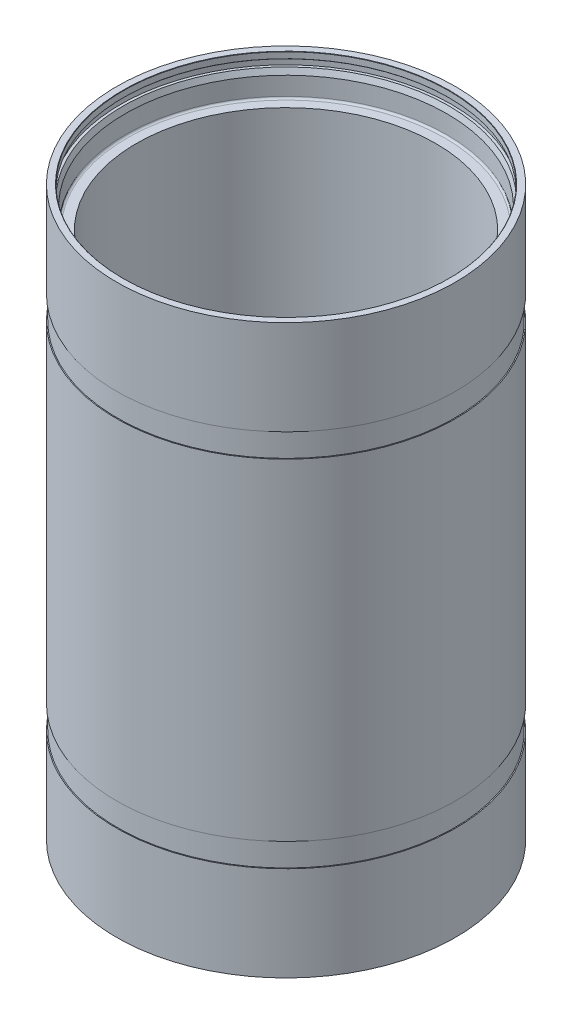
ISO-10303-21;
HEADER;
FILE_DESCRIPTION(('STEP AP214'),'2;1');
FILE_NAME('part.step','',(''),(''),'','','');
FILE_SCHEMA(('AUTOMOTIVE_DESIGN { 1 0 10303 214 1 1 1 1 }'));
ENDSEC;
DATA;
#1=APPLICATION_CONTEXT('core data for automotive mechanical design processes');
#2=APPLICATION_PROTOCOL_DEFINITION('international standard','automotive_design',2000,#1);
#3=PRODUCT_CONTEXT('',#1,'mechanical');
#4=PRODUCT('Part','Part','',(#3));
#5=PRODUCT_RELATED_PRODUCT_CATEGORY('part','',(#4));
#6=PRODUCT_DEFINITION_FORMATION('','',#4);
#7=PRODUCT_DEFINITION_CONTEXT('part definition',#1,'design');
#8=PRODUCT_DEFINITION('design','',#6,#7);
#9=PRODUCT_DEFINITION_SHAPE('','',#8);
#10=(LENGTH_UNIT() NAMED_UNIT(*) SI_UNIT(.MILLI.,.METRE.));
#11=(NAMED_UNIT(*) PLANE_ANGLE_UNIT() SI_UNIT($,.RADIAN.));
#12=(NAMED_UNIT(*) SI_UNIT($,.STERADIAN.) SOLID_ANGLE_UNIT());
#13=UNCERTAINTY_MEASURE_WITH_UNIT(LENGTH_MEASURE(1.E-05),#10,'distance_accuracy_value','');
#14=(GEOMETRIC_REPRESENTATION_CONTEXT(3) GLOBAL_UNCERTAINTY_ASSIGNED_CONTEXT((#13)) GLOBAL_UNIT_ASSIGNED_CONTEXT((#10,
#11,#12)) REPRESENTATION_CONTEXT('',''));
#15=CARTESIAN_POINT('',(0.,0.,0.));
#16=DIRECTION('',(0.,0.,1.));
#17=DIRECTION('',(1.,0.,0.));
#18=AXIS2_PLACEMENT_3D('',#15,#16,#17);
#19=CARTESIAN_POINT('',(-131.1275,228.6,0.));
#20=DIRECTION('',(0.,-1.,0.));
#21=DIRECTION('',(0.,0.,-1.));
#22=AXIS2_PLACEMENT_3D('',#19,#20,#21);
#23=PLANE('',#22);
#24=CARTESIAN_POINT('',(0.,228.6,0.));
#25=DIRECTION('',(0.,-1.,0.));
#26=DIRECTION('',(0.,0.,-1.));
#27=AXIS2_PLACEMENT_3D('',#24,#25,#26);
#28=CIRCLE('',#27,131.3815);
#29=CARTESIAN_POINT('',(0.,228.6,-131.3815));
#30=VERTEX_POINT('',#29);
#31=EDGE_CURVE('E58',#30,#30,#28,.T.);
#32=ORIENTED_EDGE('',*,*,#31,.T.);
#33=EDGE_LOOP('',(#32));
#34=FACE_BOUND('',#33,.T.);
#35=CARTESIAN_POINT('',(0.,228.6,0.));
#36=DIRECTION('',(0.,-1.,0.));
#37=DIRECTION('',(0.,0.,-1.));
#38=AXIS2_PLACEMENT_3D('',#35,#36,#37);
#39=CIRCLE('',#38,136.525);
#40=CARTESIAN_POINT('',(0.,228.6,-136.525));
#41=VERTEX_POINT('',#40);
#42=EDGE_CURVE('E76',#41,#41,#39,.T.);
#43=ORIENTED_EDGE('',*,*,#42,.F.);
#44=EDGE_LOOP('',(#43));
#45=FACE_BOUND('',#44,.T.);
#46=ADVANCED_FACE('F32',(#34,#45),#23,.F.);
#47=CARTESIAN_POINT('',(0.,0.,0.));
#48=DIRECTION('',(0.,-1.,0.));
#49=DIRECTION('',(0.,0.,-1.));
#50=AXIS2_PLACEMENT_3D('',#47,#48,#49);
#51=CYLINDRICAL_SURFACE('',#50,136.525);
#52=CARTESIAN_POINT('',(0.,152.4,0.));
#53=DIRECTION('',(0.,-1.,0.));
#54=DIRECTION('',(0.,0.,-1.));
#55=AXIS2_PLACEMENT_3D('',#52,#53,#54);
#56=CIRCLE('',#55,136.525);
#57=CARTESIAN_POINT('',(0.,152.4,-136.525));
#58=VERTEX_POINT('',#57);
#59=EDGE_CURVE('E79',#58,#58,#56,.T.);
#60=ORIENTED_EDGE('',*,*,#59,.F.);
#61=EDGE_LOOP('',(#60));
#62=FACE_BOUND('',#61,.T.);
#63=ORIENTED_EDGE('',*,*,#42,.T.);
#64=EDGE_LOOP('',(#63));
#65=FACE_BOUND('',#64,.T.);
#66=ADVANCED_FACE('F154',(#62,#65),#51,.T.);
#67=CARTESIAN_POINT('',(-136.525,152.4,0.));
#68=DIRECTION('',(0.,1.,0.));
#69=DIRECTION('',(0.,0.,1.));
#70=AXIS2_PLACEMENT_3D('',#67,#68,#69);
#71=PLANE('',#70);
#72=CARTESIAN_POINT('',(0.,152.4,0.));
#73=DIRECTION('',(0.,-1.,0.));
#74=DIRECTION('',(0.,0.,-1.));
#75=AXIS2_PLACEMENT_3D('',#72,#73,#74);
#76=CIRCLE('',#75,135.763);
#77=CARTESIAN_POINT('',(0.,152.4,-135.763));
#78=VERTEX_POINT('',#77);
#79=EDGE_CURVE('E82',#78,#78,#76,.T.);
#80=ORIENTED_EDGE('',*,*,#79,.F.);
#81=EDGE_LOOP('',(#80));
#82=FACE_BOUND('',#81,.T.);
#83=ORIENTED_EDGE('',*,*,#59,.T.);
#84=EDGE_LOOP('',(#83));
#85=FACE_BOUND('',#84,.T.);
#86=ADVANCED_FACE('F160',(#82,#85),#71,.F.);
#87=CARTESIAN_POINT('',(0.,0.,0.));
#88=DIRECTION('',(0.,-1.,0.));
#89=DIRECTION('',(0.,0.,-1.));
#90=AXIS2_PLACEMENT_3D('',#87,#88,#89);
#91=CYLINDRICAL_SURFACE('',#90,135.763);
#92=CARTESIAN_POINT('',(0.,133.35,0.));
#93=DIRECTION('',(0.,-1.,0.));
#94=DIRECTION('',(0.,0.,-1.));
#95=AXIS2_PLACEMENT_3D('',#92,#93,#94);
#96=CIRCLE('',#95,135.763);
#97=CARTESIAN_POINT('',(0.,133.35,-135.763));
#98=VERTEX_POINT('',#97);
#99=EDGE_CURVE('E85',#98,#98,#96,.T.);
#100=ORIENTED_EDGE('',*,*,#99,.F.);
#101=EDGE_LOOP('',(#100));
#102=FACE_BOUND('',#101,.T.);
#103=ORIENTED_EDGE('',*,*,#79,.T.);
#104=EDGE_LOOP('',(#103));
#105=FACE_BOUND('',#104,.T.);
#106=ADVANCED_FACE('F401',(#102,#105),#91,.T.);
#107=CARTESIAN_POINT('',(-135.763,133.35,0.));
#108=DIRECTION('',(0.,-1.,0.));
#109=DIRECTION('',(0.,0.,-1.));
#110=AXIS2_PLACEMENT_3D('',#107,#108,#109);
#111=PLANE('',#110);
#112=CARTESIAN_POINT('',(0.,133.35,0.));
#113=DIRECTION('',(0.,-1.,0.));
#114=DIRECTION('',(0.,0.,-1.));
#115=AXIS2_PLACEMENT_3D('',#112,#113,#114);
#116=CIRCLE('',#115,136.525);
#117=CARTESIAN_POINT('',(0.,133.35,-136.525));
#118=VERTEX_POINT('',#117);
#119=EDGE_CURVE('E88',#118,#118,#116,.T.);
#120=ORIENTED_EDGE('',*,*,#119,.F.);
#121=EDGE_LOOP('',(#120));
#122=FACE_BOUND('',#121,.T.);
#123=ORIENTED_EDGE('',*,*,#99,.T.);
#124=EDGE_LOOP('',(#123));
#125=FACE_BOUND('',#124,.T.);
#126=ADVANCED_FACE('F394',(#122,#125),#111,.F.);
#127=CARTESIAN_POINT('',(0.,0.,0.));
#128=DIRECTION('',(0.,-1.,0.));
#129=DIRECTION('',(0.,0.,-1.));
#130=AXIS2_PLACEMENT_3D('',#127,#128,#129);
#131=CYLINDRICAL_SURFACE('',#130,136.525);
#132=ORIENTED_EDGE('',*,*,#119,.T.);
#133=EDGE_LOOP('',(#132));
#134=FACE_BOUND('',#133,.T.);
#135=CARTESIAN_POINT('',(0.,-133.35,0.));
#136=DIRECTION('',(0.,-1.,0.));
#137=DIRECTION('',(0.,0.,-1.));
#138=AXIS2_PLACEMENT_3D('',#135,#136,#137);
#139=CIRCLE('',#138,136.525);
#140=CARTESIAN_POINT('',(0.,-133.35,-136.525));
#141=VERTEX_POINT('',#140);
#142=EDGE_CURVE('E118',#141,#141,#139,.T.);
#143=ORIENTED_EDGE('',*,*,#142,.F.);
#144=EDGE_LOOP('',(#143));
#145=FACE_BOUND('',#144,.T.);
#146=ADVANCED_FACE('F387',(#134,#145),#131,.T.);
#147=CARTESIAN_POINT('',(0.,0.,0.));
#148=DIRECTION('',(0.,-1.,0.));
#149=DIRECTION('',(0.,0.,-1.));
#150=AXIS2_PLACEMENT_3D('',#147,#148,#149);
#151=CYLINDRICAL_SURFACE('',#150,120.5611);
#152=CARTESIAN_POINT('',(0.,196.85,0.));
#153=DIRECTION('',(0.,-1.,0.));
#154=DIRECTION('',(0.,0.,-1.));
#155=AXIS2_PLACEMENT_3D('',#152,#153,#154);
#156=CIRCLE('',#155,120.5611);
#157=CARTESIAN_POINT('',(0.,196.85,-120.5611));
#158=VERTEX_POINT('',#157);
#159=EDGE_CURVE('E91',#158,#158,#156,.T.);
#160=ORIENTED_EDGE('',*,*,#159,.F.);
#161=EDGE_LOOP('',(#160));
#162=FACE_BOUND('',#161,.T.);
#163=CARTESIAN_POINT('',(0.,-196.85,0.));
#164=DIRECTION('',(0.,-1.,0.));
#165=DIRECTION('',(0.,0.,-1.));
#166=AXIS2_PLACEMENT_3D('',#163,#164,#165);
#167=CIRCLE('',#166,120.5611);
#168=CARTESIAN_POINT('',(0.,-196.85,-120.5611));
#169=VERTEX_POINT('',#168);
#170=EDGE_CURVE('E121',#169,#169,#167,.T.);
#171=ORIENTED_EDGE('',*,*,#170,.T.);
#172=EDGE_LOOP('',(#171));
#173=FACE_BOUND('',#172,.T.);
#174=ADVANCED_FACE('F380',(#162,#173),#151,.F.);
#175=CARTESIAN_POINT('',(-120.5611,196.85,0.));
#176=DIRECTION('',(0.,-1.,0.));
#177=DIRECTION('',(0.,0.,-1.));
#178=AXIS2_PLACEMENT_3D('',#175,#176,#177);
#179=PLANE('',#178);
#180=CARTESIAN_POINT('',(0.,196.85,0.));
#181=DIRECTION('',(0.,-1.,0.));
#182=DIRECTION('',(0.,0.,-1.));
#183=AXIS2_PLACEMENT_3D('',#180,#181,#182);
#184=CIRCLE('',#183,128.0414);
#185=CARTESIAN_POINT('',(0.,196.85,-128.0414));
#186=VERTEX_POINT('',#185);
#187=EDGE_CURVE('E70',#186,#186,#184,.F.);
#188=ORIENTED_EDGE('',*,*,#187,.T.);
#189=EDGE_LOOP('',(#188));
#190=FACE_BOUND('',#189,.T.);
#191=ORIENTED_EDGE('',*,*,#159,.T.);
#192=EDGE_LOOP('',(#191));
#193=FACE_BOUND('',#192,.T.);
#194=ADVANCED_FACE('F373',(#190,#193),#179,.F.);
#195=CARTESIAN_POINT('',(0.,0.,0.));
#196=DIRECTION('',(0.,-1.,0.));
#197=DIRECTION('',(0.,0.,-1.));
#198=AXIS2_PLACEMENT_3D('',#195,#196,#197);
#199=CYLINDRICAL_SURFACE('',#198,129.5654);
#200=CARTESIAN_POINT('',(0.,198.374,0.));
#201=DIRECTION('',(0.,-1.,0.));
#202=DIRECTION('',(0.,0.,-1.));
#203=AXIS2_PLACEMENT_3D('',#200,#201,#202);
#204=CIRCLE('',#203,129.5654);
#205=CARTESIAN_POINT('',(0.,198.374,-129.5654));
#206=VERTEX_POINT('',#205);
#207=EDGE_CURVE('E73',#206,#206,#204,.T.);
#208=ORIENTED_EDGE('',*,*,#207,.T.);
#209=EDGE_LOOP('',(#208));
#210=FACE_BOUND('',#209,.T.);
#211=CARTESIAN_POINT('',(0.,213.106,0.));
#212=DIRECTION('',(0.,-1.,0.));
#213=DIRECTION('',(0.,0.,-1.));
#214=AXIS2_PLACEMENT_3D('',#211,#212,#213);
#215=CIRCLE('',#214,129.5654);
#216=CARTESIAN_POINT('',(0.,213.106,-129.5654));
#217=VERTEX_POINT('',#216);
#218=EDGE_CURVE('E94',#217,#217,#215,.T.);
#219=ORIENTED_EDGE('',*,*,#218,.F.);
#220=EDGE_LOOP('',(#219));
#221=FACE_BOUND('',#220,.T.);
#222=ADVANCED_FACE('F365',(#210,#221),#199,.F.);
#223=CARTESIAN_POINT('',(0.,213.106,0.));
#224=DIRECTION('',(0.,1.,0.));
#225=DIRECTION('',(0.,0.,1.));
#226=AXIS2_PLACEMENT_3D('',#223,#224,#225);
#227=CONICAL_SURFACE('',#226,129.5654,0.349065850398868);
#228=CARTESIAN_POINT('',(0.,217.678,0.));
#229=DIRECTION('',(0.,-1.,0.));
#230=DIRECTION('',(0.,0.,-1.));
#231=AXIS2_PLACEMENT_3D('',#228,#229,#230);
#232=CIRCLE('',#231,131.229471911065);
#233=CARTESIAN_POINT('',(0.,217.678,-131.229471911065));
#234=VERTEX_POINT('',#233);
#235=EDGE_CURVE('E97',#234,#234,#232,.T.);
#236=ORIENTED_EDGE('',*,*,#235,.F.);
#237=EDGE_LOOP('',(#236));
#238=FACE_BOUND('',#237,.T.);
#239=ORIENTED_EDGE('',*,*,#218,.T.);
#240=EDGE_LOOP('',(#239));
#241=FACE_BOUND('',#240,.T.);
#242=ADVANCED_FACE('F357',(#238,#241),#227,.F.);
#243=CARTESIAN_POINT('',(-133.35,217.678,0.));
#244=DIRECTION('',(0.,-1.,0.));
#245=DIRECTION('',(0.,0.,-1.));
#246=AXIS2_PLACEMENT_3D('',#243,#244,#245);
#247=PLANE('',#246);
#248=CARTESIAN_POINT('',(0.,217.678,0.));
#249=DIRECTION('',(0.,-1.,0.));
#250=DIRECTION('',(0.,0.,-1.));
#251=AXIS2_PLACEMENT_3D('',#248,#249,#250);
#252=CIRCLE('',#251,133.35);
#253=CARTESIAN_POINT('',(0.,217.678,-133.35));
#254=VERTEX_POINT('',#253);
#255=EDGE_CURVE('E100',#254,#254,#252,.T.);
#256=ORIENTED_EDGE('',*,*,#255,.F.);
#257=EDGE_LOOP('',(#256));
#258=FACE_BOUND('',#257,.T.);
#259=ORIENTED_EDGE('',*,*,#235,.T.);
#260=EDGE_LOOP('',(#259));
#261=FACE_BOUND('',#260,.T.);
#262=ADVANCED_FACE('F348',(#258,#261),#247,.F.);
#263=CARTESIAN_POINT('',(0.,0.,0.));
#264=DIRECTION('',(0.,-1.,0.));
#265=DIRECTION('',(0.,0.,-1.));
#266=AXIS2_PLACEMENT_3D('',#263,#264,#265);
#267=CYLINDRICAL_SURFACE('',#266,133.35);
#268=CARTESIAN_POINT('',(0.,223.266,0.));
#269=DIRECTION('',(0.,-1.,0.));
#270=DIRECTION('',(0.,0.,-1.));
#271=AXIS2_PLACEMENT_3D('',#268,#269,#270);
#272=CIRCLE('',#271,133.35);
#273=CARTESIAN_POINT('',(0.,223.266,-133.35));
#274=VERTEX_POINT('',#273);
#275=EDGE_CURVE('E103',#274,#274,#272,.T.);
#276=ORIENTED_EDGE('',*,*,#275,.F.);
#277=EDGE_LOOP('',(#276));
#278=FACE_BOUND('',#277,.T.);
#279=ORIENTED_EDGE('',*,*,#255,.T.);
#280=EDGE_LOOP('',(#279));
#281=FACE_BOUND('',#280,.T.);
#282=ADVANCED_FACE('F340',(#278,#281),#267,.F.);
#283=CARTESIAN_POINT('',(-131.1275,223.266,0.));
#284=DIRECTION('',(0.,1.,0.));
#285=DIRECTION('',(0.,0.,1.));
#286=AXIS2_PLACEMENT_3D('',#283,#284,#285);
#287=PLANE('',#286);
#288=CARTESIAN_POINT('',(0.,223.266,0.));
#289=DIRECTION('',(0.,1.,0.));
#290=DIRECTION('',(0.,0.,1.));
#291=AXIS2_PLACEMENT_3D('',#288,#289,#290);
#292=CIRCLE('',#291,131.3815);
#293=CARTESIAN_POINT('',(0.,223.266,131.3815));
#294=VERTEX_POINT('',#293);
#295=EDGE_CURVE('E61',#294,#294,#292,.T.);
#296=ORIENTED_EDGE('',*,*,#295,.T.);
#297=EDGE_LOOP('',(#296));
#298=FACE_BOUND('',#297,.T.);
#299=ORIENTED_EDGE('',*,*,#275,.T.);
#300=EDGE_LOOP('',(#299));
#301=FACE_BOUND('',#300,.T.);
#302=ADVANCED_FACE('F332',(#298,#301),#287,.F.);
#303=CARTESIAN_POINT('',(0.,0.,0.));
#304=DIRECTION('',(0.,-1.,0.));
#305=DIRECTION('',(0.,0.,-1.));
#306=AXIS2_PLACEMENT_3D('',#303,#304,#305);
#307=CYLINDRICAL_SURFACE('',#306,131.1275);
#308=CARTESIAN_POINT('',(0.,223.52,0.));
#309=DIRECTION('',(0.,1.,0.));
#310=DIRECTION('',(0.,0.,1.));
#311=AXIS2_PLACEMENT_3D('',#308,#309,#310);
#312=CIRCLE('',#311,131.1275);
#313=CARTESIAN_POINT('',(0.,223.52,131.1275));
#314=VERTEX_POINT('',#313);
#315=EDGE_CURVE('E64',#314,#314,#312,.F.);
#316=ORIENTED_EDGE('',*,*,#315,.T.);
#317=EDGE_LOOP('',(#316));
#318=FACE_BOUND('',#317,.T.);
#319=CARTESIAN_POINT('',(0.,228.346,0.));
#320=DIRECTION('',(0.,-1.,0.));
#321=DIRECTION('',(0.,0.,-1.));
#322=AXIS2_PLACEMENT_3D('',#319,#320,#321);
#323=CIRCLE('',#322,131.1275);
#324=CARTESIAN_POINT('',(0.,228.346,-131.1275));
#325=VERTEX_POINT('',#324);
#326=EDGE_CURVE('E67',#325,#325,#323,.F.);
#327=ORIENTED_EDGE('',*,*,#326,.T.);
#328=EDGE_LOOP('',(#327));
#329=FACE_BOUND('',#328,.T.);
#330=ADVANCED_FACE('F170',(#318,#329),#307,.F.);
#331=CARTESIAN_POINT('',(0.,198.374,0.));
#332=DIRECTION('',(0.,-1.,0.));
#333=DIRECTION('',(0.,0.,-1.));
#334=AXIS2_PLACEMENT_3D('',#331,#332,#333);
#335=TOROIDAL_SURFACE('',#334,128.0414,1.524);
#336=ORIENTED_EDGE('',*,*,#187,.F.);
#337=EDGE_LOOP('',(#336));
#338=FACE_BOUND('',#337,.T.);
#339=ORIENTED_EDGE('',*,*,#207,.F.);
#340=EDGE_LOOP('',(#339));
#341=FACE_BOUND('',#340,.T.);
#342=ADVANCED_FACE('F166',(#338,#341),#335,.F.);
#343=CARTESIAN_POINT('',(0.,223.52,0.));
#344=DIRECTION('',(0.,-1.,0.));
#345=DIRECTION('',(0.,0.,-1.));
#346=AXIS2_PLACEMENT_3D('',#343,#344,#345);
#347=CONICAL_SURFACE('',#346,131.1275,0.785398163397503);
#348=ORIENTED_EDGE('',*,*,#295,.F.);
#349=EDGE_LOOP('',(#348));
#350=FACE_BOUND('',#349,.T.);
#351=ORIENTED_EDGE('',*,*,#315,.F.);
#352=EDGE_LOOP('',(#351));
#353=FACE_BOUND('',#352,.T.);
#354=ADVANCED_FACE('F169',(#350,#353),#347,.F.);
#355=CARTESIAN_POINT('',(0.,228.6,0.));
#356=DIRECTION('',(0.,1.,0.));
#357=DIRECTION('',(0.,0.,1.));
#358=AXIS2_PLACEMENT_3D('',#355,#356,#357);
#359=CONICAL_SURFACE('',#358,131.3815,0.785398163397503);
#360=ORIENTED_EDGE('',*,*,#326,.F.);
#361=EDGE_LOOP('',(#360));
#362=FACE_BOUND('',#361,.T.);
#363=ORIENTED_EDGE('',*,*,#31,.F.);
#364=EDGE_LOOP('',(#363));
#365=FACE_BOUND('',#364,.T.);
#366=ADVANCED_FACE('F174',(#362,#365),#359,.F.);
#367=CARTESIAN_POINT('',(-131.1275,-228.6,0.));
#368=DIRECTION('',(0.,1.,0.));
#369=DIRECTION('',(0.,0.,-1.));
#370=AXIS2_PLACEMENT_3D('',#367,#368,#369);
#371=PLANE('',#370);
#372=CARTESIAN_POINT('',(0.,-228.6,0.));
#373=DIRECTION('',(0.,1.,0.));
#374=DIRECTION('',(0.,0.,1.));
#375=AXIS2_PLACEMENT_3D('',#372,#373,#374);
#376=CIRCLE('',#375,131.3815);
#377=CARTESIAN_POINT('',(0.,-228.6,131.3815));
#378=VERTEX_POINT('',#377);
#379=EDGE_CURVE('E10',#378,#378,#376,.T.);
#380=ORIENTED_EDGE('',*,*,#379,.T.);
#381=EDGE_LOOP('',(#380));
#382=FACE_BOUND('',#381,.T.);
#383=CARTESIAN_POINT('',(0.,-228.6,0.));
#384=DIRECTION('',(0.,-1.,0.));
#385=DIRECTION('',(0.,0.,-1.));
#386=AXIS2_PLACEMENT_3D('',#383,#384,#385);
#387=CIRCLE('',#386,136.525);
#388=CARTESIAN_POINT('',(0.,-228.6,-136.525));
#389=VERTEX_POINT('',#388);
#390=EDGE_CURVE('E106',#389,#389,#387,.T.);
#391=ORIENTED_EDGE('',*,*,#390,.T.);
#392=EDGE_LOOP('',(#391));
#393=FACE_BOUND('',#392,.T.);
#394=ADVANCED_FACE('F178',(#382,#393),#371,.F.);
#395=CARTESIAN_POINT('',(0.,0.,0.));
#396=DIRECTION('',(0.,1.,0.));
#397=DIRECTION('',(0.,0.,-1.));
#398=AXIS2_PLACEMENT_3D('',#395,#396,#397);
#399=CYLINDRICAL_SURFACE('',#398,136.525);
#400=CARTESIAN_POINT('',(0.,-152.4,0.));
#401=DIRECTION('',(0.,-1.,0.));
#402=DIRECTION('',(0.,0.,-1.));
#403=AXIS2_PLACEMENT_3D('',#400,#401,#402);
#404=CIRCLE('',#403,136.525);
#405=CARTESIAN_POINT('',(0.,-152.4,-136.525));
#406=VERTEX_POINT('',#405);
#407=EDGE_CURVE('E109',#406,#406,#404,.T.);
#408=ORIENTED_EDGE('',*,*,#407,.T.);
#409=EDGE_LOOP('',(#408));
#410=FACE_BOUND('',#409,.T.);
#411=ORIENTED_EDGE('',*,*,#390,.F.);
#412=EDGE_LOOP('',(#411));
#413=FACE_BOUND('',#412,.T.);
#414=ADVANCED_FACE('F291',(#410,#413),#399,.T.);
#415=CARTESIAN_POINT('',(-136.525,-152.4,0.));
#416=DIRECTION('',(0.,-1.,0.));
#417=DIRECTION('',(0.,0.,1.));
#418=AXIS2_PLACEMENT_3D('',#415,#416,#417);
#419=PLANE('',#418);
#420=CARTESIAN_POINT('',(0.,-152.4,0.));
#421=DIRECTION('',(0.,-1.,0.));
#422=DIRECTION('',(0.,0.,-1.));
#423=AXIS2_PLACEMENT_3D('',#420,#421,#422);
#424=CIRCLE('',#423,135.763);
#425=CARTESIAN_POINT('',(0.,-152.4,-135.763));
#426=VERTEX_POINT('',#425);
#427=EDGE_CURVE('E112',#426,#426,#424,.T.);
#428=ORIENTED_EDGE('',*,*,#427,.T.);
#429=EDGE_LOOP('',(#428));
#430=FACE_BOUND('',#429,.T.);
#431=ORIENTED_EDGE('',*,*,#407,.F.);
#432=EDGE_LOOP('',(#431));
#433=FACE_BOUND('',#432,.T.);
#434=ADVANCED_FACE('F281',(#430,#433),#419,.F.);
#435=CARTESIAN_POINT('',(0.,0.,0.));
#436=DIRECTION('',(0.,1.,0.));
#437=DIRECTION('',(0.,0.,-1.));
#438=AXIS2_PLACEMENT_3D('',#435,#436,#437);
#439=CYLINDRICAL_SURFACE('',#438,135.763);
#440=CARTESIAN_POINT('',(0.,-133.35,0.));
#441=DIRECTION('',(0.,-1.,0.));
#442=DIRECTION('',(0.,0.,-1.));
#443=AXIS2_PLACEMENT_3D('',#440,#441,#442);
#444=CIRCLE('',#443,135.763);
#445=CARTESIAN_POINT('',(0.,-133.35,-135.763));
#446=VERTEX_POINT('',#445);
#447=EDGE_CURVE('E115',#446,#446,#444,.T.);
#448=ORIENTED_EDGE('',*,*,#447,.T.);
#449=EDGE_LOOP('',(#448));
#450=FACE_BOUND('',#449,.T.);
#451=ORIENTED_EDGE('',*,*,#427,.F.);
#452=EDGE_LOOP('',(#451));
#453=FACE_BOUND('',#452,.T.);
#454=ADVANCED_FACE('F271',(#450,#453),#439,.T.);
#455=CARTESIAN_POINT('',(-135.763,-133.35,0.));
#456=DIRECTION('',(0.,1.,0.));
#457=DIRECTION('',(0.,0.,-1.));
#458=AXIS2_PLACEMENT_3D('',#455,#456,#457);
#459=PLANE('',#458);
#460=ORIENTED_EDGE('',*,*,#142,.T.);
#461=EDGE_LOOP('',(#460));
#462=FACE_BOUND('',#461,.T.);
#463=ORIENTED_EDGE('',*,*,#447,.F.);
#464=EDGE_LOOP('',(#463));
#465=FACE_BOUND('',#464,.T.);
#466=ADVANCED_FACE('F261',(#462,#465),#459,.F.);
#467=CARTESIAN_POINT('',(-120.5611,-196.85,0.));
#468=DIRECTION('',(0.,1.,0.));
#469=DIRECTION('',(0.,0.,-1.));
#470=AXIS2_PLACEMENT_3D('',#467,#468,#469);
#471=PLANE('',#470);
#472=CARTESIAN_POINT('',(0.,-196.85,0.));
#473=DIRECTION('',(0.,1.,0.));
#474=DIRECTION('',(0.,0.,1.));
#475=AXIS2_PLACEMENT_3D('',#472,#473,#474);
#476=CIRCLE('',#475,128.0414);
#477=CARTESIAN_POINT('',(0.,-196.85,128.0414));
#478=VERTEX_POINT('',#477);
#479=EDGE_CURVE('E55',#478,#478,#476,.F.);
#480=ORIENTED_EDGE('',*,*,#479,.T.);
#481=EDGE_LOOP('',(#480));
#482=FACE_BOUND('',#481,.T.);
#483=ORIENTED_EDGE('',*,*,#170,.F.);
#484=EDGE_LOOP('',(#483));
#485=FACE_BOUND('',#484,.T.);
#486=ADVANCED_FACE('F251',(#482,#485),#471,.F.);
#487=CARTESIAN_POINT('',(0.,0.,0.));
#488=DIRECTION('',(0.,1.,0.));
#489=DIRECTION('',(0.,0.,-1.));
#490=AXIS2_PLACEMENT_3D('',#487,#488,#489);
#491=CYLINDRICAL_SURFACE('',#490,129.5654);
#492=CARTESIAN_POINT('',(0.,-198.374,0.));
#493=DIRECTION('',(0.,1.,0.));
#494=DIRECTION('',(0.,0.,1.));
#495=AXIS2_PLACEMENT_3D('',#492,#493,#494);
#496=CIRCLE('',#495,129.5654);
#497=CARTESIAN_POINT('',(0.,-198.374,129.5654));
#498=VERTEX_POINT('',#497);
#499=EDGE_CURVE('E52',#498,#498,#496,.T.);
#500=ORIENTED_EDGE('',*,*,#499,.T.);
#501=EDGE_LOOP('',(#500));
#502=FACE_BOUND('',#501,.T.);
#503=CARTESIAN_POINT('',(0.,-213.106,0.));
#504=DIRECTION('',(0.,-1.,0.));
#505=DIRECTION('',(0.,0.,-1.));
#506=AXIS2_PLACEMENT_3D('',#503,#504,#505);
#507=CIRCLE('',#506,129.5654);
#508=CARTESIAN_POINT('',(0.,-213.106,-129.5654));
#509=VERTEX_POINT('',#508);
#510=EDGE_CURVE('E124',#509,#509,#507,.T.);
#511=ORIENTED_EDGE('',*,*,#510,.T.);
#512=EDGE_LOOP('',(#511));
#513=FACE_BOUND('',#512,.T.);
#514=ADVANCED_FACE('F241',(#502,#513),#491,.F.);
#515=CARTESIAN_POINT('',(0.,-213.106,0.));
#516=DIRECTION('',(0.,-1.,0.));
#517=DIRECTION('',(0.,0.,1.));
#518=AXIS2_PLACEMENT_3D('',#515,#516,#517);
#519=CONICAL_SURFACE('',#518,129.5654,0.349065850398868);
#520=CARTESIAN_POINT('',(0.,-217.678,0.));
#521=DIRECTION('',(0.,-1.,0.));
#522=DIRECTION('',(0.,0.,-1.));
#523=AXIS2_PLACEMENT_3D('',#520,#521,#522);
#524=CIRCLE('',#523,131.229471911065);
#525=CARTESIAN_POINT('',(0.,-217.678,-131.229471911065));
#526=VERTEX_POINT('',#525);
#527=EDGE_CURVE('E127',#526,#526,#524,.T.);
#528=ORIENTED_EDGE('',*,*,#527,.T.);
#529=EDGE_LOOP('',(#528));
#530=FACE_BOUND('',#529,.T.);
#531=ORIENTED_EDGE('',*,*,#510,.F.);
#532=EDGE_LOOP('',(#531));
#533=FACE_BOUND('',#532,.T.);
#534=ADVANCED_FACE('F231',(#530,#533),#519,.F.);
#535=CARTESIAN_POINT('',(-133.35,-217.678,0.));
#536=DIRECTION('',(0.,1.,0.));
#537=DIRECTION('',(0.,0.,-1.));
#538=AXIS2_PLACEMENT_3D('',#535,#536,#537);
#539=PLANE('',#538);
#540=CARTESIAN_POINT('',(0.,-217.678,0.));
#541=DIRECTION('',(0.,-1.,0.));
#542=DIRECTION('',(0.,0.,-1.));
#543=AXIS2_PLACEMENT_3D('',#540,#541,#542);
#544=CIRCLE('',#543,133.35);
#545=CARTESIAN_POINT('',(0.,-217.678,-133.35));
#546=VERTEX_POINT('',#545);
#547=EDGE_CURVE('E130',#546,#546,#544,.T.);
#548=ORIENTED_EDGE('',*,*,#547,.T.);
#549=EDGE_LOOP('',(#548));
#550=FACE_BOUND('',#549,.T.);
#551=ORIENTED_EDGE('',*,*,#527,.F.);
#552=EDGE_LOOP('',(#551));
#553=FACE_BOUND('',#552,.T.);
#554=ADVANCED_FACE('F151',(#550,#553),#539,.F.);
#555=CARTESIAN_POINT('',(0.,0.,0.));
#556=DIRECTION('',(0.,1.,0.));
#557=DIRECTION('',(0.,0.,-1.));
#558=AXIS2_PLACEMENT_3D('',#555,#556,#557);
#559=CYLINDRICAL_SURFACE('',#558,133.35);
#560=CARTESIAN_POINT('',(0.,-223.266,0.));
#561=DIRECTION('',(0.,-1.,0.));
#562=DIRECTION('',(0.,0.,-1.));
#563=AXIS2_PLACEMENT_3D('',#560,#561,#562);
#564=CIRCLE('',#563,133.35);
#565=CARTESIAN_POINT('',(0.,-223.266,-133.35));
#566=VERTEX_POINT('',#565);
#567=EDGE_CURVE('E133',#566,#566,#564,.T.);
#568=ORIENTED_EDGE('',*,*,#567,.T.);
#569=EDGE_LOOP('',(#568));
#570=FACE_BOUND('',#569,.T.);
#571=ORIENTED_EDGE('',*,*,#547,.F.);
#572=EDGE_LOOP('',(#571));
#573=FACE_BOUND('',#572,.T.);
#574=ADVANCED_FACE('F137',(#570,#573),#559,.F.);
#575=CARTESIAN_POINT('',(-131.1275,-223.266,0.));
#576=DIRECTION('',(0.,-1.,0.));
#577=DIRECTION('',(0.,0.,1.));
#578=AXIS2_PLACEMENT_3D('',#575,#576,#577);
#579=PLANE('',#578);
#580=CARTESIAN_POINT('',(0.,-223.266,0.));
#581=DIRECTION('',(0.,-1.,0.));
#582=DIRECTION('',(0.,0.,-1.));
#583=AXIS2_PLACEMENT_3D('',#580,#581,#582);
#584=CIRCLE('',#583,131.3815);
#585=CARTESIAN_POINT('',(0.,-223.266,-131.3815));
#586=VERTEX_POINT('',#585);
#587=EDGE_CURVE('E47',#586,#586,#584,.T.);
#588=ORIENTED_EDGE('',*,*,#587,.T.);
#589=EDGE_LOOP('',(#588));
#590=FACE_BOUND('',#589,.T.);
#591=ORIENTED_EDGE('',*,*,#567,.F.);
#592=EDGE_LOOP('',(#591));
#593=FACE_BOUND('',#592,.T.);
#594=ADVANCED_FACE('F140',(#590,#593),#579,.F.);
#595=CARTESIAN_POINT('',(0.,0.,0.));
#596=DIRECTION('',(0.,1.,0.));
#597=DIRECTION('',(0.,0.,-1.));
#598=AXIS2_PLACEMENT_3D('',#595,#596,#597);
#599=CYLINDRICAL_SURFACE('',#598,131.1275);
#600=CARTESIAN_POINT('',(0.,-223.52,0.));
#601=DIRECTION('',(0.,-1.,0.));
#602=DIRECTION('',(0.,0.,-1.));
#603=AXIS2_PLACEMENT_3D('',#600,#601,#602);
#604=CIRCLE('',#603,131.1275);
#605=CARTESIAN_POINT('',(0.,-223.52,-131.1275));
#606=VERTEX_POINT('',#605);
#607=EDGE_CURVE('E39',#606,#606,#604,.F.);
#608=ORIENTED_EDGE('',*,*,#607,.T.);
#609=EDGE_LOOP('',(#608));
#610=FACE_BOUND('',#609,.T.);
#611=CARTESIAN_POINT('',(0.,-228.346,0.));
#612=DIRECTION('',(0.,1.,0.));
#613=DIRECTION('',(0.,0.,1.));
#614=AXIS2_PLACEMENT_3D('',#611,#612,#613);
#615=CIRCLE('',#614,131.1275);
#616=CARTESIAN_POINT('',(0.,-228.346,131.1275));
#617=VERTEX_POINT('',#616);
#618=EDGE_CURVE('E43',#617,#617,#615,.F.);
#619=ORIENTED_EDGE('',*,*,#618,.T.);
#620=EDGE_LOOP('',(#619));
#621=FACE_BOUND('',#620,.T.);
#622=ADVANCED_FACE('F142',(#610,#621),#599,.F.);
#623=CARTESIAN_POINT('',(0.,-198.374,0.));
#624=DIRECTION('',(0.,1.,0.));
#625=DIRECTION('',(0.,0.,1.));
#626=AXIS2_PLACEMENT_3D('',#623,#624,#625);
#627=TOROIDAL_SURFACE('',#626,128.0414,1.524);
#628=ORIENTED_EDGE('',*,*,#499,.F.);
#629=EDGE_LOOP('',(#628));
#630=FACE_BOUND('',#629,.T.);
#631=ORIENTED_EDGE('',*,*,#479,.F.);
#632=EDGE_LOOP('',(#631));
#633=FACE_BOUND('',#632,.T.);
#634=ADVANCED_FACE('F149',(#630,#633),#627,.F.);
#635=CARTESIAN_POINT('',(0.,-223.266,0.));
#636=DIRECTION('',(0.,1.,0.));
#637=DIRECTION('',(0.,0.,1.));
#638=AXIS2_PLACEMENT_3D('',#635,#636,#637);
#639=CONICAL_SURFACE('',#638,131.3815,0.785398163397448);
#640=ORIENTED_EDGE('',*,*,#607,.F.);
#641=EDGE_LOOP('',(#640));
#642=FACE_BOUND('',#641,.T.);
#643=ORIENTED_EDGE('',*,*,#587,.F.);
#644=EDGE_LOOP('',(#643));
#645=FACE_BOUND('',#644,.T.);
#646=ADVANCED_FACE('F181',(#642,#645),#639,.F.);
#647=CARTESIAN_POINT('',(0.,-228.346,0.));
#648=DIRECTION('',(0.,-1.,0.));
#649=DIRECTION('',(0.,0.,-1.));
#650=AXIS2_PLACEMENT_3D('',#647,#648,#649);
#651=CONICAL_SURFACE('',#650,131.1275,0.785398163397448);
#652=ORIENTED_EDGE('',*,*,#379,.F.);
#653=EDGE_LOOP('',(#652));
#654=FACE_BOUND('',#653,.T.);
#655=ORIENTED_EDGE('',*,*,#618,.F.);
#656=EDGE_LOOP('',(#655));
#657=FACE_BOUND('',#656,.T.);
#658=ADVANCED_FACE('F34',(#654,#657),#651,.F.);
#659=CLOSED_SHELL('',(#46,#66,#86,#106,#126,#146,#174,#194,#222,#242,#262,#282,#302,#330,#342,
#354,#366,#394,#414,#434,#454,#466,#486,#514,#534,#554,#574,#594,#622,#634,#646,#658));
#660=MANIFOLD_SOLID_BREP('B2',#659);
#661=ADVANCED_BREP_SHAPE_REPRESENTATION('',(#18,#660),#14);
#662=SHAPE_DEFINITION_REPRESENTATION(#9,#661);
ENDSEC;
END-ISO-10303-21;
